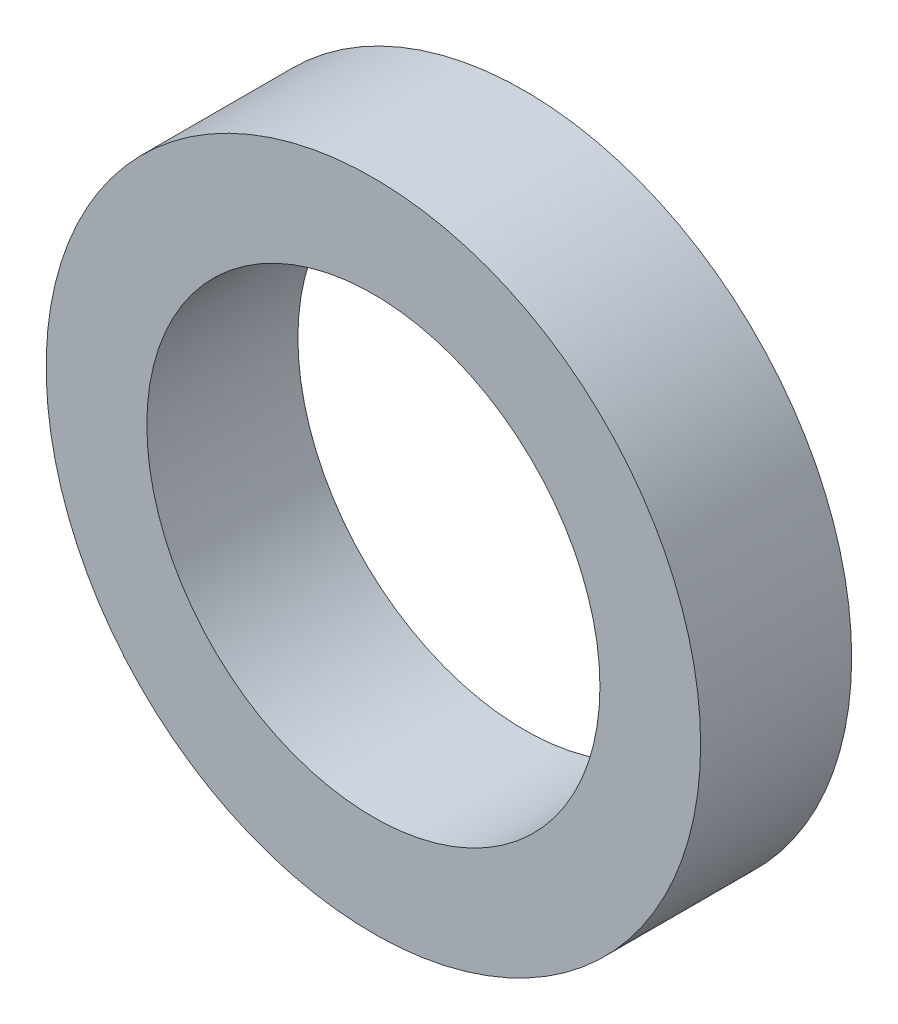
ISO-10303-21;
HEADER;
FILE_DESCRIPTION(('STEP AP214'),'2;1');
FILE_NAME('part.step','',(''),(''),'','','');
FILE_SCHEMA(('AUTOMOTIVE_DESIGN { 1 0 10303 214 1 1 1 1 }'));
ENDSEC;
DATA;
#1=APPLICATION_CONTEXT('core data for automotive mechanical design processes');
#2=APPLICATION_PROTOCOL_DEFINITION('international standard','automotive_design',2000,#1);
#3=PRODUCT_CONTEXT('',#1,'mechanical');
#4=PRODUCT('Part','Part','',(#3));
#5=PRODUCT_RELATED_PRODUCT_CATEGORY('part','',(#4));
#6=PRODUCT_DEFINITION_FORMATION('','',#4);
#7=PRODUCT_DEFINITION_CONTEXT('part definition',#1,'design');
#8=PRODUCT_DEFINITION('design','',#6,#7);
#9=PRODUCT_DEFINITION_SHAPE('','',#8);
#10=(LENGTH_UNIT() NAMED_UNIT(*) SI_UNIT(.MILLI.,.METRE.));
#11=(NAMED_UNIT(*) PLANE_ANGLE_UNIT() SI_UNIT($,.RADIAN.));
#12=(NAMED_UNIT(*) SI_UNIT($,.STERADIAN.) SOLID_ANGLE_UNIT());
#13=UNCERTAINTY_MEASURE_WITH_UNIT(LENGTH_MEASURE(1.E-05),#10,'distance_accuracy_value','');
#14=(GEOMETRIC_REPRESENTATION_CONTEXT(3) GLOBAL_UNCERTAINTY_ASSIGNED_CONTEXT((#13)) GLOBAL_UNIT_ASSIGNED_CONTEXT((#10,
#11,#12)) REPRESENTATION_CONTEXT('',''));
#15=CARTESIAN_POINT('',(0.,0.,0.));
#16=DIRECTION('',(0.,0.,1.));
#17=DIRECTION('',(1.,0.,0.));
#18=AXIS2_PLACEMENT_3D('',#15,#16,#17);
#19=CARTESIAN_POINT('',(0.,0.,0.));
#20=DIRECTION('',(0.,0.,1.));
#21=DIRECTION('',(1.,0.,0.));
#22=AXIS2_PLACEMENT_3D('',#19,#20,#21);
#23=CYLINDRICAL_SURFACE('',#22,4.5);
#24=CARTESIAN_POINT('',(0.,0.,-3.));
#25=DIRECTION('',(0.,0.,1.));
#26=DIRECTION('',(1.,0.,0.));
#27=AXIS2_PLACEMENT_3D('',#24,#25,#26);
#28=CIRCLE('',#27,4.5);
#29=CARTESIAN_POINT('',(4.5,0.,-3.));
#30=VERTEX_POINT('',#29);
#31=EDGE_CURVE('E10',#30,#30,#28,.T.);
#32=ORIENTED_EDGE('',*,*,#31,.F.);
#33=EDGE_LOOP('',(#32));
#34=FACE_BOUND('',#33,.T.);
#35=CARTESIAN_POINT('',(0.,0.,0.));
#36=DIRECTION('',(0.,0.,1.));
#37=DIRECTION('',(1.,0.,0.));
#38=AXIS2_PLACEMENT_3D('',#35,#36,#37);
#39=CIRCLE('',#38,4.5);
#40=CARTESIAN_POINT('',(4.5,0.,0.));
#41=VERTEX_POINT('',#40);
#42=EDGE_CURVE('E47',#41,#41,#39,.T.);
#43=ORIENTED_EDGE('',*,*,#42,.T.);
#44=EDGE_LOOP('',(#43));
#45=FACE_BOUND('',#44,.T.);
#46=ADVANCED_FACE('F33',(#34,#45),#23,.F.);
#47=CARTESIAN_POINT('',(-4.5,0.,-3.));
#48=DIRECTION('',(0.,0.,1.));
#49=DIRECTION('',(1.,0.,0.));
#50=AXIS2_PLACEMENT_3D('',#47,#48,#49);
#51=PLANE('',#50);
#52=CARTESIAN_POINT('',(0.,0.,-3.));
#53=DIRECTION('',(0.,0.,1.));
#54=DIRECTION('',(1.,0.,0.));
#55=AXIS2_PLACEMENT_3D('',#52,#53,#54);
#56=CIRCLE('',#55,6.5);
#57=CARTESIAN_POINT('',(6.5,0.,-3.));
#58=VERTEX_POINT('',#57);
#59=EDGE_CURVE('E39',#58,#58,#56,.T.);
#60=ORIENTED_EDGE('',*,*,#59,.F.);
#61=EDGE_LOOP('',(#60));
#62=FACE_BOUND('',#61,.T.);
#63=ORIENTED_EDGE('',*,*,#31,.T.);
#64=EDGE_LOOP('',(#63));
#65=FACE_BOUND('',#64,.T.);
#66=ADVANCED_FACE('F62',(#62,#65),#51,.F.);
#67=CARTESIAN_POINT('',(0.,0.,0.));
#68=DIRECTION('',(0.,0.,1.));
#69=DIRECTION('',(1.,0.,0.));
#70=AXIS2_PLACEMENT_3D('',#67,#68,#69);
#71=CYLINDRICAL_SURFACE('',#70,6.5);
#72=CARTESIAN_POINT('',(0.,0.,0.));
#73=DIRECTION('',(0.,0.,1.));
#74=DIRECTION('',(1.,0.,0.));
#75=AXIS2_PLACEMENT_3D('',#72,#73,#74);
#76=CIRCLE('',#75,6.5);
#77=CARTESIAN_POINT('',(6.5,0.,0.));
#78=VERTEX_POINT('',#77);
#79=EDGE_CURVE('E43',#78,#78,#76,.T.);
#80=ORIENTED_EDGE('',*,*,#79,.F.);
#81=EDGE_LOOP('',(#80));
#82=FACE_BOUND('',#81,.T.);
#83=ORIENTED_EDGE('',*,*,#59,.T.);
#84=EDGE_LOOP('',(#83));
#85=FACE_BOUND('',#84,.T.);
#86=ADVANCED_FACE('F57',(#82,#85),#71,.T.);
#87=CARTESIAN_POINT('',(-4.5,0.,0.));
#88=DIRECTION('',(0.,0.,-1.));
#89=DIRECTION('',(-1.,0.,0.));
#90=AXIS2_PLACEMENT_3D('',#87,#88,#89);
#91=PLANE('',#90);
#92=ORIENTED_EDGE('',*,*,#42,.F.);
#93=EDGE_LOOP('',(#92));
#94=FACE_BOUND('',#93,.T.);
#95=ORIENTED_EDGE('',*,*,#79,.T.);
#96=EDGE_LOOP('',(#95));
#97=FACE_BOUND('',#96,.T.);
#98=ADVANCED_FACE('F54',(#94,#97),#91,.F.);
#99=CLOSED_SHELL('',(#46,#66,#86,#98));
#100=MANIFOLD_SOLID_BREP('B2',#99);
#101=ADVANCED_BREP_SHAPE_REPRESENTATION('',(#18,#100),#14);
#102=SHAPE_DEFINITION_REPRESENTATION(#9,#101);
ENDSEC;
END-ISO-10303-21;
